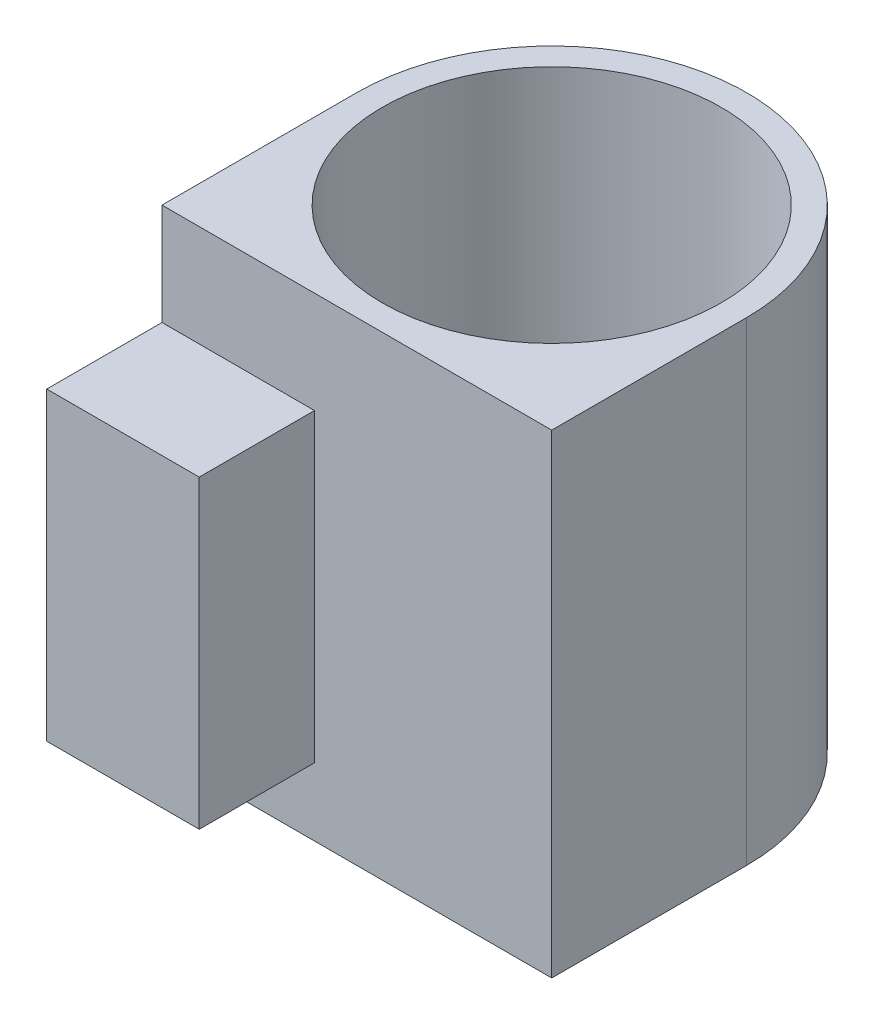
ISO-10303-21;
HEADER;
FILE_DESCRIPTION(('STEP AP214'),'2;1');
FILE_NAME('part.step','',(''),(''),'','','');
FILE_SCHEMA(('AUTOMOTIVE_DESIGN { 1 0 10303 214 1 1 1 1 }'));
ENDSEC;
DATA;
#1=APPLICATION_CONTEXT('core data for automotive mechanical design processes');
#2=APPLICATION_PROTOCOL_DEFINITION('international standard','automotive_design',2000,#1);
#3=PRODUCT_CONTEXT('',#1,'mechanical');
#4=PRODUCT('Part','Part','',(#3));
#5=PRODUCT_RELATED_PRODUCT_CATEGORY('part','',(#4));
#6=PRODUCT_DEFINITION_FORMATION('','',#4);
#7=PRODUCT_DEFINITION_CONTEXT('part definition',#1,'design');
#8=PRODUCT_DEFINITION('design','',#6,#7);
#9=PRODUCT_DEFINITION_SHAPE('','',#8);
#10=(LENGTH_UNIT() NAMED_UNIT(*) SI_UNIT(.MILLI.,.METRE.));
#11=(NAMED_UNIT(*) PLANE_ANGLE_UNIT() SI_UNIT($,.RADIAN.));
#12=(NAMED_UNIT(*) SI_UNIT($,.STERADIAN.) SOLID_ANGLE_UNIT());
#13=UNCERTAINTY_MEASURE_WITH_UNIT(LENGTH_MEASURE(1.E-05),#10,'distance_accuracy_value','');
#14=(GEOMETRIC_REPRESENTATION_CONTEXT(3) GLOBAL_UNCERTAINTY_ASSIGNED_CONTEXT((#13)) GLOBAL_UNIT_ASSIGNED_CONTEXT((#10,
#11,#12)) REPRESENTATION_CONTEXT('',''));
#15=CARTESIAN_POINT('',(0.,0.,0.));
#16=DIRECTION('',(0.,0.,1.));
#17=DIRECTION('',(1.,0.,0.));
#18=AXIS2_PLACEMENT_3D('',#15,#16,#17);
#19=CARTESIAN_POINT('',(0.,0.,0.));
#20=DIRECTION('',(0.,1.,0.));
#21=DIRECTION('',(0.,0.,1.));
#22=AXIS2_PLACEMENT_3D('',#19,#20,#21);
#23=PLANE('',#22);
#24=DIRECTION('',(-0.965925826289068,0.,0.258819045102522));
#25=VECTOR('',#24,1.);
#26=CARTESIAN_POINT('',(-0.667346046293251,0.,-2.49056935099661));
#27=LINE('',#26,#25);
#28=CARTESIAN_POINT('',(-3.39939685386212,0.,-1.75851854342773));
#29=VERTEX_POINT('',#28);
#30=CARTESIAN_POINT('',(-4.80526603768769,0.,-1.38181703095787));
#31=VERTEX_POINT('',#30);
#32=EDGE_CURVE('E12',#29,#31,#27,.T.);
#33=ORIENTED_EDGE('',*,*,#32,.T.);
#34=CARTESIAN_POINT('',(0.,0.,0.));
#35=DIRECTION('',(0.,1.,0.));
#36=DIRECTION('',(0.,0.,1.));
#37=AXIS2_PLACEMENT_3D('',#34,#35,#36);
#38=CIRCLE('',#37,5.);
#39=CARTESIAN_POINT('',(-3.59932167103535,0.,-3.4705739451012));
#40=VERTEX_POINT('',#39);
#41=EDGE_CURVE('E67',#40,#31,#38,.T.);
#42=ORIENTED_EDGE('',*,*,#41,.F.);
#43=DIRECTION('',(0.258819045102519,0.,0.965925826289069));
#44=VECTOR('',#43,1.);
#45=CARTESIAN_POINT('',(-2.49056935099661,0.,0.667346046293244));
#46=LINE('',#45,#44);
#47=CARTESIAN_POINT('',(-3.22262015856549,0.,-2.06470476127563));
#48=VERTEX_POINT('',#47);
#49=EDGE_CURVE('E127',#40,#48,#46,.T.);
#50=ORIENTED_EDGE('',*,*,#49,.T.);
#51=CARTESIAN_POINT('',(-3.46410161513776,0.,-2.));
#52=DIRECTION('',(0.,1.,0.));
#53=DIRECTION('',(0.,0.,1.));
#54=AXIS2_PLACEMENT_3D('',#51,#52,#53);
#55=CIRCLE('',#54,0.250000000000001);
#56=EDGE_CURVE('E113',#29,#48,#55,.T.);
#57=ORIENTED_EDGE('',*,*,#56,.F.);
#58=EDGE_LOOP('',(#33,#42,#50,#57));
#59=FACE_BOUND('',#58,.T.);
#60=ADVANCED_FACE('F58',(#59),#23,.F.);
#61=CARTESIAN_POINT('',(0.,6.71656166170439,0.));
#62=DIRECTION('',(0.,-1.,0.));
#63=DIRECTION('',(0.,0.,-1.));
#64=AXIS2_PLACEMENT_3D('',#61,#62,#63);
#65=CYLINDRICAL_SURFACE('',#64,5.);
#66=DIRECTION('',(0.,-1.,0.));
#67=VECTOR('',#66,1.);
#68=CARTESIAN_POINT('',(-4.80526603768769,6.71656166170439,-1.38181703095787));
#69=LINE('',#68,#67);
#70=CARTESIAN_POINT('',(-4.80526603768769,4.,-1.38181703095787));
#71=VERTEX_POINT('',#70);
#72=EDGE_CURVE('E75',#71,#31,#69,.T.);
#73=ORIENTED_EDGE('',*,*,#72,.F.);
#74=CARTESIAN_POINT('',(0.,4.,0.));
#75=DIRECTION('',(0.,-1.,0.));
#76=DIRECTION('',(0.,0.,-1.));
#77=AXIS2_PLACEMENT_3D('',#74,#75,#76);
#78=CIRCLE('',#77,5.);
#79=CARTESIAN_POINT('',(-3.59932167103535,4.,-3.4705739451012));
#80=VERTEX_POINT('',#79);
#81=EDGE_CURVE('E120',#71,#80,#78,.T.);
#82=ORIENTED_EDGE('',*,*,#81,.T.);
#83=DIRECTION('',(0.,-1.,0.));
#84=VECTOR('',#83,1.);
#85=CARTESIAN_POINT('',(-3.59932167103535,6.71656166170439,-3.4705739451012));
#86=LINE('',#85,#84);
#87=EDGE_CURVE('E82',#80,#40,#86,.T.);
#88=ORIENTED_EDGE('',*,*,#87,.T.);
#89=ORIENTED_EDGE('',*,*,#41,.T.);
#90=EDGE_LOOP('',(#73,#82,#88,#89));
#91=FACE_BOUND('',#90,.T.);
#92=ADVANCED_FACE('F130',(#91),#65,.T.);
#93=CARTESIAN_POINT('',(-2.49056935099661,6.71656166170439,0.667346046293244));
#94=DIRECTION('',(0.965925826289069,0.,-0.258819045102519));
#95=DIRECTION('',(-0.258819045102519,0.,-0.965925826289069));
#96=AXIS2_PLACEMENT_3D('',#93,#94,#95);
#97=PLANE('',#96);
#98=DIRECTION('',(-0.258819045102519,0.,-0.965925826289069));
#99=VECTOR('',#98,1.);
#100=CARTESIAN_POINT('',(-2.49056935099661,4.,0.667346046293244));
#101=LINE('',#100,#99);
#102=CARTESIAN_POINT('',(-3.22262015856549,4.,-2.06470476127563));
#103=VERTEX_POINT('',#102);
#104=EDGE_CURVE('E62',#103,#80,#101,.T.);
#105=ORIENTED_EDGE('',*,*,#104,.F.);
#106=DIRECTION('',(0.,-1.,0.));
#107=VECTOR('',#106,1.);
#108=CARTESIAN_POINT('',(-3.22262015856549,6.71656166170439,-2.06470476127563));
#109=LINE('',#108,#107);
#110=EDGE_CURVE('E110',#103,#48,#109,.T.);
#111=ORIENTED_EDGE('',*,*,#110,.T.);
#112=ORIENTED_EDGE('',*,*,#49,.F.);
#113=ORIENTED_EDGE('',*,*,#87,.F.);
#114=EDGE_LOOP('',(#105,#111,#112,#113));
#115=FACE_BOUND('',#114,.T.);
#116=ADVANCED_FACE('F119',(#115),#97,.T.);
#117=CARTESIAN_POINT('',(-3.46410161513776,6.71656166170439,-2.));
#118=DIRECTION('',(0.,-1.,0.));
#119=DIRECTION('',(0.,0.,-1.));
#120=AXIS2_PLACEMENT_3D('',#117,#118,#119);
#121=CYLINDRICAL_SURFACE('',#120,0.250000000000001);
#122=ORIENTED_EDGE('',*,*,#110,.F.);
#123=CARTESIAN_POINT('',(-3.46410161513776,4.,-2.));
#124=DIRECTION('',(0.,-1.,0.));
#125=DIRECTION('',(0.,0.,-1.));
#126=AXIS2_PLACEMENT_3D('',#123,#124,#125);
#127=CIRCLE('',#126,0.250000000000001);
#128=CARTESIAN_POINT('',(-3.39939685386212,4.,-1.75851854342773));
#129=VERTEX_POINT('',#128);
#130=EDGE_CURVE('E103',#103,#129,#127,.T.);
#131=ORIENTED_EDGE('',*,*,#130,.T.);
#132=DIRECTION('',(0.,-1.,0.));
#133=VECTOR('',#132,1.);
#134=CARTESIAN_POINT('',(-3.39939685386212,6.71656166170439,-1.75851854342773));
#135=LINE('',#134,#133);
#136=EDGE_CURVE('E117',#129,#29,#135,.T.);
#137=ORIENTED_EDGE('',*,*,#136,.T.);
#138=ORIENTED_EDGE('',*,*,#56,.T.);
#139=EDGE_LOOP('',(#122,#131,#137,#138));
#140=FACE_BOUND('',#139,.T.);
#141=ADVANCED_FACE('F111',(#140),#121,.T.);
#142=CARTESIAN_POINT('',(-0.667346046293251,6.71656166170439,-2.49056935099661));
#143=DIRECTION('',(0.258819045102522,0.,0.965925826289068));
#144=DIRECTION('',(0.965925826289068,0.,-0.258819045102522));
#145=AXIS2_PLACEMENT_3D('',#142,#143,#144);
#146=PLANE('',#145);
#147=DIRECTION('',(0.965925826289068,0.,-0.258819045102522));
#148=VECTOR('',#147,1.);
#149=CARTESIAN_POINT('',(-0.667346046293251,4.,-2.49056935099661));
#150=LINE('',#149,#148);
#151=EDGE_CURVE('E106',#71,#129,#150,.T.);
#152=ORIENTED_EDGE('',*,*,#151,.F.);
#153=ORIENTED_EDGE('',*,*,#72,.T.);
#154=ORIENTED_EDGE('',*,*,#32,.F.);
#155=ORIENTED_EDGE('',*,*,#136,.F.);
#156=EDGE_LOOP('',(#152,#153,#154,#155));
#157=FACE_BOUND('',#156,.T.);
#158=ADVANCED_FACE('F132',(#157),#146,.T.);
#159=CARTESIAN_POINT('',(0.,4.,0.));
#160=DIRECTION('',(0.,-1.,0.));
#161=DIRECTION('',(0.,0.,-1.));
#162=AXIS2_PLACEMENT_3D('',#159,#160,#161);
#163=PLANE('',#162);
#164=ORIENTED_EDGE('',*,*,#151,.T.);
#165=ORIENTED_EDGE('',*,*,#130,.F.);
#166=ORIENTED_EDGE('',*,*,#104,.T.);
#167=ORIENTED_EDGE('',*,*,#81,.F.);
#168=EDGE_LOOP('',(#164,#165,#166,#167));
#169=FACE_BOUND('',#168,.T.);
#170=ADVANCED_FACE('F60',(#169),#163,.F.);
#171=CLOSED_SHELL('',(#60,#92,#116,#141,#158,#170));
#172=MANIFOLD_SOLID_BREP('B2',#171);
#173=CARTESIAN_POINT('',(0.,0.,0.));
#174=DIRECTION('',(0.,1.,0.));
#175=DIRECTION('',(0.,0.,1.));
#176=AXIS2_PLACEMENT_3D('',#173,#174,#175);
#177=PLANE('',#176);
#178=DIRECTION('',(0.258819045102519,0.,-0.965925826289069));
#179=VECTOR('',#178,1.);
#180=CARTESIAN_POINT('',(2.49056935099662,0.,0.667346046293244));
#181=LINE('',#180,#179);
#182=CARTESIAN_POINT('',(3.22262015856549,0.,-2.06470476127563));
#183=VERTEX_POINT('',#182);
#184=CARTESIAN_POINT('',(3.59932167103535,0.,-3.4705739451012));
#185=VERTEX_POINT('',#184);
#186=EDGE_CURVE('E56',#183,#185,#181,.T.);
#187=ORIENTED_EDGE('',*,*,#186,.T.);
#188=CARTESIAN_POINT('',(0.,0.,0.));
#189=DIRECTION('',(0.,1.,0.));
#190=DIRECTION('',(0.,0.,1.));
#191=AXIS2_PLACEMENT_3D('',#188,#189,#190);
#192=CIRCLE('',#191,5.);
#193=CARTESIAN_POINT('',(4.80526603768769,0.,-1.38181703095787));
#194=VERTEX_POINT('',#193);
#195=EDGE_CURVE('E201',#194,#185,#192,.T.);
#196=ORIENTED_EDGE('',*,*,#195,.F.);
#197=DIRECTION('',(-0.965925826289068,0.,-0.258819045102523));
#198=VECTOR('',#197,1.);
#199=CARTESIAN_POINT('',(0.667346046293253,0.,-2.49056935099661));
#200=LINE('',#199,#198);
#201=CARTESIAN_POINT('',(3.39939685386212,0.,-1.75851854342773));
#202=VERTEX_POINT('',#201);
#203=EDGE_CURVE('E261',#194,#202,#200,.T.);
#204=ORIENTED_EDGE('',*,*,#203,.T.);
#205=CARTESIAN_POINT('',(3.46410161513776,0.,-2.));
#206=DIRECTION('',(0.,1.,0.));
#207=DIRECTION('',(0.,0.,1.));
#208=AXIS2_PLACEMENT_3D('',#205,#206,#207);
#209=CIRCLE('',#208,0.25);
#210=EDGE_CURVE('E247',#183,#202,#209,.T.);
#211=ORIENTED_EDGE('',*,*,#210,.F.);
#212=EDGE_LOOP('',(#187,#196,#204,#211));
#213=FACE_BOUND('',#212,.T.);
#214=ADVANCED_FACE('F192',(#213),#177,.F.);
#215=CARTESIAN_POINT('',(0.,6.71656166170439,0.));
#216=DIRECTION('',(0.,-1.,0.));
#217=DIRECTION('',(0.,0.,-1.));
#218=AXIS2_PLACEMENT_3D('',#215,#216,#217);
#219=CYLINDRICAL_SURFACE('',#218,5.);
#220=DIRECTION('',(0.,-1.,0.));
#221=VECTOR('',#220,1.);
#222=CARTESIAN_POINT('',(3.59932167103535,6.71656166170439,-3.4705739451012));
#223=LINE('',#222,#221);
#224=CARTESIAN_POINT('',(3.59932167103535,4.,-3.4705739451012));
#225=VERTEX_POINT('',#224);
#226=EDGE_CURVE('E209',#225,#185,#223,.T.);
#227=ORIENTED_EDGE('',*,*,#226,.F.);
#228=CARTESIAN_POINT('',(0.,4.,0.));
#229=DIRECTION('',(0.,-1.,0.));
#230=DIRECTION('',(0.,0.,-1.));
#231=AXIS2_PLACEMENT_3D('',#228,#229,#230);
#232=CIRCLE('',#231,5.);
#233=CARTESIAN_POINT('',(4.80526603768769,4.,-1.38181703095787));
#234=VERTEX_POINT('',#233);
#235=EDGE_CURVE('E254',#225,#234,#232,.T.);
#236=ORIENTED_EDGE('',*,*,#235,.T.);
#237=DIRECTION('',(0.,-1.,0.));
#238=VECTOR('',#237,1.);
#239=CARTESIAN_POINT('',(4.80526603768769,6.71656166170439,-1.38181703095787));
#240=LINE('',#239,#238);
#241=EDGE_CURVE('E216',#234,#194,#240,.T.);
#242=ORIENTED_EDGE('',*,*,#241,.T.);
#243=ORIENTED_EDGE('',*,*,#195,.T.);
#244=EDGE_LOOP('',(#227,#236,#242,#243));
#245=FACE_BOUND('',#244,.T.);
#246=ADVANCED_FACE('F264',(#245),#219,.T.);
#247=CARTESIAN_POINT('',(0.667346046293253,6.71656166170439,-2.49056935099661));
#248=DIRECTION('',(-0.258819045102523,0.,0.965925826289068));
#249=DIRECTION('',(0.965925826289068,0.,0.258819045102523));
#250=AXIS2_PLACEMENT_3D('',#247,#248,#249);
#251=PLANE('',#250);
#252=DIRECTION('',(0.965925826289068,0.,0.258819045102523));
#253=VECTOR('',#252,1.);
#254=CARTESIAN_POINT('',(0.667346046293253,4.,-2.49056935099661));
#255=LINE('',#254,#253);
#256=CARTESIAN_POINT('',(3.39939685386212,4.,-1.75851854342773));
#257=VERTEX_POINT('',#256);
#258=EDGE_CURVE('E196',#257,#234,#255,.T.);
#259=ORIENTED_EDGE('',*,*,#258,.F.);
#260=DIRECTION('',(0.,-1.,0.));
#261=VECTOR('',#260,1.);
#262=CARTESIAN_POINT('',(3.39939685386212,6.71656166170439,-1.75851854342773));
#263=LINE('',#262,#261);
#264=EDGE_CURVE('E244',#257,#202,#263,.T.);
#265=ORIENTED_EDGE('',*,*,#264,.T.);
#266=ORIENTED_EDGE('',*,*,#203,.F.);
#267=ORIENTED_EDGE('',*,*,#241,.F.);
#268=EDGE_LOOP('',(#259,#265,#266,#267));
#269=FACE_BOUND('',#268,.T.);
#270=ADVANCED_FACE('F253',(#269),#251,.T.);
#271=CARTESIAN_POINT('',(3.46410161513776,6.71656166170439,-2.));
#272=DIRECTION('',(0.,-1.,0.));
#273=DIRECTION('',(0.,0.,-1.));
#274=AXIS2_PLACEMENT_3D('',#271,#272,#273);
#275=CYLINDRICAL_SURFACE('',#274,0.25);
#276=ORIENTED_EDGE('',*,*,#264,.F.);
#277=CARTESIAN_POINT('',(3.46410161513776,4.,-2.));
#278=DIRECTION('',(0.,-1.,0.));
#279=DIRECTION('',(0.,0.,-1.));
#280=AXIS2_PLACEMENT_3D('',#277,#278,#279);
#281=CIRCLE('',#280,0.25);
#282=CARTESIAN_POINT('',(3.22262015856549,4.,-2.06470476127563));
#283=VERTEX_POINT('',#282);
#284=EDGE_CURVE('E237',#257,#283,#281,.T.);
#285=ORIENTED_EDGE('',*,*,#284,.T.);
#286=DIRECTION('',(0.,-1.,0.));
#287=VECTOR('',#286,1.);
#288=CARTESIAN_POINT('',(3.22262015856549,6.71656166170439,-2.06470476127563));
#289=LINE('',#288,#287);
#290=EDGE_CURVE('E251',#283,#183,#289,.T.);
#291=ORIENTED_EDGE('',*,*,#290,.T.);
#292=ORIENTED_EDGE('',*,*,#210,.T.);
#293=EDGE_LOOP('',(#276,#285,#291,#292));
#294=FACE_BOUND('',#293,.T.);
#295=ADVANCED_FACE('F245',(#294),#275,.T.);
#296=CARTESIAN_POINT('',(2.49056935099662,6.71656166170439,0.667346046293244));
#297=DIRECTION('',(-0.965925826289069,0.,-0.258819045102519));
#298=DIRECTION('',(-0.258819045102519,0.,0.965925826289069));
#299=AXIS2_PLACEMENT_3D('',#296,#297,#298);
#300=PLANE('',#299);
#301=DIRECTION('',(-0.258819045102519,0.,0.965925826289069));
#302=VECTOR('',#301,1.);
#303=CARTESIAN_POINT('',(2.49056935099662,4.,0.667346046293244));
#304=LINE('',#303,#302);
#305=EDGE_CURVE('E240',#225,#283,#304,.T.);
#306=ORIENTED_EDGE('',*,*,#305,.F.);
#307=ORIENTED_EDGE('',*,*,#226,.T.);
#308=ORIENTED_EDGE('',*,*,#186,.F.);
#309=ORIENTED_EDGE('',*,*,#290,.F.);
#310=EDGE_LOOP('',(#306,#307,#308,#309));
#311=FACE_BOUND('',#310,.T.);
#312=ADVANCED_FACE('F266',(#311),#300,.T.);
#313=CARTESIAN_POINT('',(0.,4.,0.));
#314=DIRECTION('',(0.,-1.,0.));
#315=DIRECTION('',(0.,0.,-1.));
#316=AXIS2_PLACEMENT_3D('',#313,#314,#315);
#317=PLANE('',#316);
#318=ORIENTED_EDGE('',*,*,#305,.T.);
#319=ORIENTED_EDGE('',*,*,#284,.F.);
#320=ORIENTED_EDGE('',*,*,#258,.T.);
#321=ORIENTED_EDGE('',*,*,#235,.F.);
#322=EDGE_LOOP('',(#318,#319,#320,#321));
#323=FACE_BOUND('',#322,.T.);
#324=ADVANCED_FACE('F194',(#323),#317,.F.);
#325=CLOSED_SHELL('',(#214,#246,#270,#295,#312,#324));
#326=MANIFOLD_SOLID_BREP('B6',#325);
#327=CARTESIAN_POINT('',(0.,0.,0.));
#328=DIRECTION('',(0.,1.,0.));
#329=DIRECTION('',(0.,0.,1.));
#330=AXIS2_PLACEMENT_3D('',#327,#328,#329);
#331=PLANE('',#330);
#332=DIRECTION('',(0.707106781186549,0.,0.707106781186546));
#333=VECTOR('',#332,1.);
#334=CARTESIAN_POINT('',(-1.82322330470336,0.,1.82322330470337));
#335=LINE('',#334,#333);
#336=CARTESIAN_POINT('',(0.176776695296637,0.,3.82322330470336));
#337=VERTEX_POINT('',#336);
#338=CARTESIAN_POINT('',(1.20594436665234,0.,4.85239097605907));
#339=VERTEX_POINT('',#338);
#340=EDGE_CURVE('E368',#337,#339,#335,.T.);
#341=ORIENTED_EDGE('',*,*,#340,.T.);
#342=CARTESIAN_POINT('',(0.,0.,0.));
#343=DIRECTION('',(0.,1.,0.));
#344=DIRECTION('',(0.,0.,1.));
#345=AXIS2_PLACEMENT_3D('',#342,#343,#344);
#346=CIRCLE('',#345,5.);
#347=CARTESIAN_POINT('',(-1.20594436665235,0.,4.85239097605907));
#348=VERTEX_POINT('',#347);
#349=EDGE_CURVE('E374',#348,#339,#346,.T.);
#350=ORIENTED_EDGE('',*,*,#349,.F.);
#351=DIRECTION('',(0.707106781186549,0.,-0.707106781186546));
#352=VECTOR('',#351,1.);
#353=CARTESIAN_POINT('',(1.82322330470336,0.,1.82322330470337));
#354=LINE('',#353,#352);
#355=CARTESIAN_POINT('',(-0.176776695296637,0.,3.82322330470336));
#356=VERTEX_POINT('',#355);
#357=EDGE_CURVE('E380',#348,#356,#354,.T.);
#358=ORIENTED_EDGE('',*,*,#357,.T.);
#359=CARTESIAN_POINT('',(0.,0.,4.));
#360=DIRECTION('',(0.,1.,0.));
#361=DIRECTION('',(0.,0.,1.));
#362=AXIS2_PLACEMENT_3D('',#359,#360,#361);
#363=CIRCLE('',#362,0.250000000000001);
#364=EDGE_CURVE('E372',#337,#356,#363,.T.);
#365=ORIENTED_EDGE('',*,*,#364,.F.);
#366=EDGE_LOOP('',(#341,#350,#358,#365));
#367=FACE_BOUND('',#366,.T.);
#368=ADVANCED_FACE('F326',(#367),#331,.F.);
#369=CARTESIAN_POINT('',(0.,6.71656166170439,0.));
#370=DIRECTION('',(0.,-1.,0.));
#371=DIRECTION('',(0.,0.,-1.));
#372=AXIS2_PLACEMENT_3D('',#369,#370,#371);
#373=CYLINDRICAL_SURFACE('',#372,5.);
#374=DIRECTION('',(0.,-1.,0.));
#375=VECTOR('',#374,1.);
#376=CARTESIAN_POINT('',(1.20594436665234,6.71656166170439,4.85239097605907));
#377=LINE('',#376,#375);
#378=CARTESIAN_POINT('',(1.20594436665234,4.,4.85239097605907));
#379=VERTEX_POINT('',#378);
#380=EDGE_CURVE('E365',#379,#339,#377,.T.);
#381=ORIENTED_EDGE('',*,*,#380,.F.);
#382=CARTESIAN_POINT('',(0.,4.,0.));
#383=DIRECTION('',(0.,-1.,0.));
#384=DIRECTION('',(0.,0.,-1.));
#385=AXIS2_PLACEMENT_3D('',#382,#383,#384);
#386=CIRCLE('',#385,5.);
#387=CARTESIAN_POINT('',(-1.20594436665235,4.,4.85239097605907));
#388=VERTEX_POINT('',#387);
#389=EDGE_CURVE('E330',#379,#388,#386,.T.);
#390=ORIENTED_EDGE('',*,*,#389,.T.);
#391=DIRECTION('',(0.,-1.,0.));
#392=VECTOR('',#391,1.);
#393=CARTESIAN_POINT('',(-1.20594436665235,6.71656166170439,4.85239097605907));
#394=LINE('',#393,#392);
#395=EDGE_CURVE('E371',#388,#348,#394,.T.);
#396=ORIENTED_EDGE('',*,*,#395,.T.);
#397=ORIENTED_EDGE('',*,*,#349,.T.);
#398=EDGE_LOOP('',(#381,#390,#396,#397));
#399=FACE_BOUND('',#398,.T.);
#400=ADVANCED_FACE('F375',(#399),#373,.T.);
#401=CARTESIAN_POINT('',(1.82322330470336,6.71656166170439,1.82322330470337));
#402=DIRECTION('',(-0.707106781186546,0.,-0.707106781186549));
#403=DIRECTION('',(-0.707106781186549,0.,0.707106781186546));
#404=AXIS2_PLACEMENT_3D('',#401,#402,#403);
#405=PLANE('',#404);
#406=DIRECTION('',(-0.707106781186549,0.,0.707106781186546));
#407=VECTOR('',#406,1.);
#408=CARTESIAN_POINT('',(1.82322330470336,4.,1.82322330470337));
#409=LINE('',#408,#407);
#410=CARTESIAN_POINT('',(-0.176776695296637,4.,3.82322330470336));
#411=VERTEX_POINT('',#410);
#412=EDGE_CURVE('E396',#411,#388,#409,.T.);
#413=ORIENTED_EDGE('',*,*,#412,.F.);
#414=DIRECTION('',(0.,-1.,0.));
#415=VECTOR('',#414,1.);
#416=CARTESIAN_POINT('',(-0.176776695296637,6.71656166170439,3.82322330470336));
#417=LINE('',#416,#415);
#418=EDGE_CURVE('E391',#411,#356,#417,.T.);
#419=ORIENTED_EDGE('',*,*,#418,.T.);
#420=ORIENTED_EDGE('',*,*,#357,.F.);
#421=ORIENTED_EDGE('',*,*,#395,.F.);
#422=EDGE_LOOP('',(#413,#419,#420,#421));
#423=FACE_BOUND('',#422,.T.);
#424=ADVANCED_FACE('F395',(#423),#405,.T.);
#425=CARTESIAN_POINT('',(0.,6.71656166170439,4.));
#426=DIRECTION('',(0.,-1.,0.));
#427=DIRECTION('',(0.,0.,-1.));
#428=AXIS2_PLACEMENT_3D('',#425,#426,#427);
#429=CYLINDRICAL_SURFACE('',#428,0.250000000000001);
#430=ORIENTED_EDGE('',*,*,#418,.F.);
#431=CARTESIAN_POINT('',(0.,4.,4.));
#432=DIRECTION('',(0.,-1.,0.));
#433=DIRECTION('',(0.,0.,-1.));
#434=AXIS2_PLACEMENT_3D('',#431,#432,#433);
#435=CIRCLE('',#434,0.250000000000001);
#436=CARTESIAN_POINT('',(0.176776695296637,4.,3.82322330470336));
#437=VERTEX_POINT('',#436);
#438=EDGE_CURVE('E335',#411,#437,#435,.T.);
#439=ORIENTED_EDGE('',*,*,#438,.T.);
#440=DIRECTION('',(0.,-1.,0.));
#441=VECTOR('',#440,1.);
#442=CARTESIAN_POINT('',(0.176776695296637,6.71656166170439,3.82322330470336));
#443=LINE('',#442,#441);
#444=EDGE_CURVE('E389',#437,#337,#443,.T.);
#445=ORIENTED_EDGE('',*,*,#444,.T.);
#446=ORIENTED_EDGE('',*,*,#364,.T.);
#447=EDGE_LOOP('',(#430,#439,#445,#446));
#448=FACE_BOUND('',#447,.T.);
#449=ADVANCED_FACE('F398',(#448),#429,.T.);
#450=CARTESIAN_POINT('',(-1.82322330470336,6.71656166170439,1.82322330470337));
#451=DIRECTION('',(0.707106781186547,0.,-0.707106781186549));
#452=DIRECTION('',(-0.707106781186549,0.,-0.707106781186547));
#453=AXIS2_PLACEMENT_3D('',#450,#451,#452);
#454=PLANE('',#453);
#455=DIRECTION('',(-0.707106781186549,0.,-0.707106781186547));
#456=VECTOR('',#455,1.);
#457=CARTESIAN_POINT('',(-1.82322330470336,4.,1.82322330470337));
#458=LINE('',#457,#456);
#459=EDGE_CURVE('E190',#379,#437,#458,.T.);
#460=ORIENTED_EDGE('',*,*,#459,.F.);
#461=ORIENTED_EDGE('',*,*,#380,.T.);
#462=ORIENTED_EDGE('',*,*,#340,.F.);
#463=ORIENTED_EDGE('',*,*,#444,.F.);
#464=EDGE_LOOP('',(#460,#461,#462,#463));
#465=FACE_BOUND('',#464,.T.);
#466=ADVANCED_FACE('F328',(#465),#454,.T.);
#467=CARTESIAN_POINT('',(0.,4.,0.));
#468=DIRECTION('',(0.,-1.,0.));
#469=DIRECTION('',(0.,0.,-1.));
#470=AXIS2_PLACEMENT_3D('',#467,#468,#469);
#471=PLANE('',#470);
#472=ORIENTED_EDGE('',*,*,#459,.T.);
#473=ORIENTED_EDGE('',*,*,#438,.F.);
#474=ORIENTED_EDGE('',*,*,#412,.T.);
#475=ORIENTED_EDGE('',*,*,#389,.F.);
#476=EDGE_LOOP('',(#472,#473,#474,#475));
#477=FACE_BOUND('',#476,.T.);
#478=ADVANCED_FACE('F400',(#477),#471,.F.);
#479=CLOSED_SHELL('',(#368,#400,#424,#449,#466,#478));
#480=MANIFOLD_SOLID_BREP('B50',#479);
#481=CARTESIAN_POINT('',(2.38156986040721,2.5,1.375));
#482=DIRECTION('',(0.,1.,0.));
#483=DIRECTION('',(0.,0.,1.));
#484=AXIS2_PLACEMENT_3D('',#481,#482,#483);
#485=CYLINDRICAL_SURFACE('',#484,0.249999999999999);
#486=CARTESIAN_POINT('',(2.38156986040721,5.,1.375));
#487=DIRECTION('',(0.,-1.,0.));
#488=DIRECTION('',(0.,0.,1.));
#489=AXIS2_PLACEMENT_3D('',#486,#487,#488);
#490=CIRCLE('',#489,0.249999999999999);
#491=CARTESIAN_POINT('',(2.1832315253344,5.,1.52719035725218));
#492=VERTEX_POINT('',#491);
#493=CARTESIAN_POINT('',(2.41420140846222,5.,1.12713878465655));
#494=VERTEX_POINT('',#493);
#495=EDGE_CURVE('E324',#492,#494,#490,.T.);
#496=ORIENTED_EDGE('',*,*,#495,.T.);
#497=DIRECTION('',(0.,1.,0.));
#498=VECTOR('',#497,1.);
#499=CARTESIAN_POINT('',(2.41420140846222,2.5,1.12713878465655));
#500=LINE('',#499,#498);
#501=CARTESIAN_POINT('',(2.41420140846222,2.5,1.12713878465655));
#502=VERTEX_POINT('',#501);
#503=EDGE_CURVE('E531',#502,#494,#500,.T.);
#504=ORIENTED_EDGE('',*,*,#503,.F.);
#505=CARTESIAN_POINT('',(2.38156986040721,2.5,1.375));
#506=DIRECTION('',(0.,-1.,0.));
#507=DIRECTION('',(0.,0.,1.));
#508=AXIS2_PLACEMENT_3D('',#505,#506,#507);
#509=CIRCLE('',#508,0.249999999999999);
#510=CARTESIAN_POINT('',(2.1832315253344,2.5,1.52719035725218));
#511=VERTEX_POINT('',#510);
#512=EDGE_CURVE('E464',#511,#502,#509,.T.);
#513=ORIENTED_EDGE('',*,*,#512,.F.);
#514=DIRECTION('',(0.,1.,0.));
#515=VECTOR('',#514,1.);
#516=CARTESIAN_POINT('',(2.1832315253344,2.5,1.52719035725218));
#517=LINE('',#516,#515);
#518=EDGE_CURVE('E519',#511,#492,#517,.T.);
#519=ORIENTED_EDGE('',*,*,#518,.T.);
#520=EDGE_LOOP('',(#496,#504,#513,#519));
#521=FACE_BOUND('',#520,.T.);
#522=ADVANCED_FACE('F460',(#521),#485,.T.);
#523=CARTESIAN_POINT('',(4.78824596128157,2.5,1.43968767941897));
#524=DIRECTION('',(-0.130526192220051,0.,0.991444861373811));
#525=DIRECTION('',(0.991444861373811,0.,0.130526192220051));
#526=AXIS2_PLACEMENT_3D('',#523,#524,#525);
#527=PLANE('',#526);
#528=DIRECTION('',(0.991444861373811,0.,0.130526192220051));
#529=VECTOR('',#528,1.);
#530=CARTESIAN_POINT('',(4.78824596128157,5.,1.43968767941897));
#531=LINE('',#530,#529);
#532=CARTESIAN_POINT('',(4.78824596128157,5.,1.43968767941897));
#533=VERTEX_POINT('',#532);
#534=EDGE_CURVE('E470',#494,#533,#531,.T.);
#535=ORIENTED_EDGE('',*,*,#534,.T.);
#536=DIRECTION('',(0.,1.,0.));
#537=VECTOR('',#536,1.);
#538=CARTESIAN_POINT('',(4.78824596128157,2.5,1.43968767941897));
#539=LINE('',#538,#537);
#540=CARTESIAN_POINT('',(4.78824596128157,2.5,1.43968767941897));
#541=VERTEX_POINT('',#540);
#542=EDGE_CURVE('E515',#541,#533,#539,.T.);
#543=ORIENTED_EDGE('',*,*,#542,.F.);
#544=DIRECTION('',(0.991444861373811,0.,0.130526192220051));
#545=VECTOR('',#544,1.);
#546=CARTESIAN_POINT('',(4.78824596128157,2.5,1.43968767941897));
#547=LINE('',#546,#545);
#548=EDGE_CURVE('E494',#502,#541,#547,.T.);
#549=ORIENTED_EDGE('',*,*,#548,.F.);
#550=ORIENTED_EDGE('',*,*,#503,.T.);
#551=EDGE_LOOP('',(#535,#543,#549,#550));
#552=FACE_BOUND('',#551,.T.);
#553=ADVANCED_FACE('F534',(#552),#527,.F.);
#554=CARTESIAN_POINT('',(0.,2.5,0.));
#555=DIRECTION('',(0.,1.,0.));
#556=DIRECTION('',(0.,0.,1.));
#557=AXIS2_PLACEMENT_3D('',#554,#555,#556);
#558=CYLINDRICAL_SURFACE('',#557,5.);
#559=CARTESIAN_POINT('',(0.,5.,0.));
#560=DIRECTION('',(0.,-1.,0.));
#561=DIRECTION('',(0.,0.,1.));
#562=AXIS2_PLACEMENT_3D('',#559,#560,#561);
#563=CIRCLE('',#562,5.);
#564=CARTESIAN_POINT('',(3.64092908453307,5.,3.4268988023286));
#565=VERTEX_POINT('',#564);
#566=EDGE_CURVE('E510',#533,#565,#563,.T.);
#567=ORIENTED_EDGE('',*,*,#566,.T.);
#568=DIRECTION('',(0.,1.,0.));
#569=VECTOR('',#568,1.);
#570=CARTESIAN_POINT('',(3.64092908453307,2.5,3.4268988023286));
#571=LINE('',#570,#569);
#572=CARTESIAN_POINT('',(3.64092908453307,2.5,3.4268988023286));
#573=VERTEX_POINT('',#572);
#574=EDGE_CURVE('E513',#573,#565,#571,.T.);
#575=ORIENTED_EDGE('',*,*,#574,.F.);
#576=CARTESIAN_POINT('',(0.,2.5,0.));
#577=DIRECTION('',(0.,-1.,0.));
#578=DIRECTION('',(0.,0.,1.));
#579=AXIS2_PLACEMENT_3D('',#576,#577,#578);
#580=CIRCLE('',#579,5.);
#581=EDGE_CURVE('E527',#541,#573,#580,.T.);
#582=ORIENTED_EDGE('',*,*,#581,.F.);
#583=ORIENTED_EDGE('',*,*,#542,.T.);
#584=EDGE_LOOP('',(#567,#575,#582,#583));
#585=FACE_BOUND('',#584,.T.);
#586=ADVANCED_FACE('F511',(#585),#558,.T.);
#587=CARTESIAN_POINT('',(3.64092908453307,2.5,3.4268988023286));
#588=DIRECTION('',(0.793353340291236,0.,-0.608761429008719));
#589=DIRECTION('',(-0.608761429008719,0.,-0.793353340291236));
#590=AXIS2_PLACEMENT_3D('',#587,#588,#589);
#591=PLANE('',#590);
#592=DIRECTION('',(-0.608761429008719,0.,-0.793353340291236));
#593=VECTOR('',#592,1.);
#594=CARTESIAN_POINT('',(3.64092908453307,5.,3.4268988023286));
#595=LINE('',#594,#593);
#596=EDGE_CURVE('E504',#565,#492,#595,.T.);
#597=ORIENTED_EDGE('',*,*,#596,.T.);
#598=ORIENTED_EDGE('',*,*,#518,.F.);
#599=DIRECTION('',(-0.608761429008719,0.,-0.793353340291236));
#600=VECTOR('',#599,1.);
#601=CARTESIAN_POINT('',(3.64092908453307,2.5,3.4268988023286));
#602=LINE('',#601,#600);
#603=EDGE_CURVE('E518',#573,#511,#602,.T.);
#604=ORIENTED_EDGE('',*,*,#603,.F.);
#605=ORIENTED_EDGE('',*,*,#574,.T.);
#606=EDGE_LOOP('',(#597,#598,#604,#605));
#607=FACE_BOUND('',#606,.T.);
#608=ADVANCED_FACE('F517',(#607),#591,.F.);
#609=CARTESIAN_POINT('',(2.38156986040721,2.5,1.375));
#610=DIRECTION('',(0.,1.,0.));
#611=DIRECTION('',(0.,0.,1.));
#612=AXIS2_PLACEMENT_3D('',#609,#610,#611);
#613=PLANE('',#612);
#614=ORIENTED_EDGE('',*,*,#512,.T.);
#615=ORIENTED_EDGE('',*,*,#548,.T.);
#616=ORIENTED_EDGE('',*,*,#581,.T.);
#617=ORIENTED_EDGE('',*,*,#603,.T.);
#618=EDGE_LOOP('',(#614,#615,#616,#617));
#619=FACE_BOUND('',#618,.T.);
#620=ADVANCED_FACE('F462',(#619),#613,.F.);
#621=CARTESIAN_POINT('',(2.38156986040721,5.,1.375));
#622=DIRECTION('',(0.,1.,0.));
#623=DIRECTION('',(0.,0.,1.));
#624=AXIS2_PLACEMENT_3D('',#621,#622,#623);
#625=PLANE('',#624);
#626=ORIENTED_EDGE('',*,*,#495,.F.);
#627=ORIENTED_EDGE('',*,*,#596,.F.);
#628=ORIENTED_EDGE('',*,*,#566,.F.);
#629=ORIENTED_EDGE('',*,*,#534,.F.);
#630=EDGE_LOOP('',(#626,#627,#628,#629));
#631=FACE_BOUND('',#630,.T.);
#632=ADVANCED_FACE('F521',(#631),#625,.T.);
#633=CLOSED_SHELL('',(#522,#553,#586,#608,#620,#632));
#634=MANIFOLD_SOLID_BREP('B184',#633);
#635=CARTESIAN_POINT('',(-2.38156986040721,2.5,1.375));
#636=DIRECTION('',(0.,1.,0.));
#637=DIRECTION('',(0.,0.,1.));
#638=AXIS2_PLACEMENT_3D('',#635,#636,#637);
#639=CYLINDRICAL_SURFACE('',#638,0.249999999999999);
#640=CARTESIAN_POINT('',(-2.38156986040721,5.,1.375));
#641=DIRECTION('',(0.,-1.,0.));
#642=DIRECTION('',(0.,0.,1.));
#643=AXIS2_PLACEMENT_3D('',#640,#641,#642);
#644=CIRCLE('',#643,0.249999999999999);
#645=CARTESIAN_POINT('',(-2.41420140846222,5.,1.12713878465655));
#646=VERTEX_POINT('',#645);
#647=CARTESIAN_POINT('',(-2.1832315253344,5.,1.52719035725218));
#648=VERTEX_POINT('',#647);
#649=EDGE_CURVE('E458',#646,#648,#644,.T.);
#650=ORIENTED_EDGE('',*,*,#649,.T.);
#651=DIRECTION('',(0.,1.,0.));
#652=VECTOR('',#651,1.);
#653=CARTESIAN_POINT('',(-2.1832315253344,2.5,1.52719035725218));
#654=LINE('',#653,#652);
#655=CARTESIAN_POINT('',(-2.1832315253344,2.5,1.52719035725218));
#656=VERTEX_POINT('',#655);
#657=EDGE_CURVE('E665',#656,#648,#654,.T.);
#658=ORIENTED_EDGE('',*,*,#657,.F.);
#659=CARTESIAN_POINT('',(-2.38156986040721,2.5,1.375));
#660=DIRECTION('',(0.,-1.,0.));
#661=DIRECTION('',(0.,0.,1.));
#662=AXIS2_PLACEMENT_3D('',#659,#660,#661);
#663=CIRCLE('',#662,0.249999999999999);
#664=CARTESIAN_POINT('',(-2.41420140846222,2.5,1.12713878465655));
#665=VERTEX_POINT('',#664);
#666=EDGE_CURVE('E598',#665,#656,#663,.T.);
#667=ORIENTED_EDGE('',*,*,#666,.F.);
#668=DIRECTION('',(0.,1.,0.));
#669=VECTOR('',#668,1.);
#670=CARTESIAN_POINT('',(-2.41420140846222,2.5,1.12713878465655));
#671=LINE('',#670,#669);
#672=EDGE_CURVE('E653',#665,#646,#671,.T.);
#673=ORIENTED_EDGE('',*,*,#672,.T.);
#674=EDGE_LOOP('',(#650,#658,#667,#673));
#675=FACE_BOUND('',#674,.T.);
#676=ADVANCED_FACE('F594',(#675),#639,.T.);
#677=CARTESIAN_POINT('',(-3.64092908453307,2.5,3.42689880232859));
#678=DIRECTION('',(-0.793353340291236,0.,-0.60876142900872));
#679=DIRECTION('',(-0.60876142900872,0.,0.793353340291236));
#680=AXIS2_PLACEMENT_3D('',#677,#678,#679);
#681=PLANE('',#680);
#682=DIRECTION('',(-0.60876142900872,0.,0.793353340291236));
#683=VECTOR('',#682,1.);
#684=CARTESIAN_POINT('',(-3.64092908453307,5.,3.42689880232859));
#685=LINE('',#684,#683);
#686=CARTESIAN_POINT('',(-3.64092908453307,5.,3.42689880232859));
#687=VERTEX_POINT('',#686);
#688=EDGE_CURVE('E604',#648,#687,#685,.T.);
#689=ORIENTED_EDGE('',*,*,#688,.T.);
#690=DIRECTION('',(0.,1.,0.));
#691=VECTOR('',#690,1.);
#692=CARTESIAN_POINT('',(-3.64092908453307,2.5,3.42689880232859));
#693=LINE('',#692,#691);
#694=CARTESIAN_POINT('',(-3.64092908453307,2.5,3.42689880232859));
#695=VERTEX_POINT('',#694);
#696=EDGE_CURVE('E649',#695,#687,#693,.T.);
#697=ORIENTED_EDGE('',*,*,#696,.F.);
#698=DIRECTION('',(-0.60876142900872,0.,0.793353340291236));
#699=VECTOR('',#698,1.);
#700=CARTESIAN_POINT('',(-3.64092908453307,2.5,3.42689880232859));
#701=LINE('',#700,#699);
#702=EDGE_CURVE('E628',#656,#695,#701,.T.);
#703=ORIENTED_EDGE('',*,*,#702,.F.);
#704=ORIENTED_EDGE('',*,*,#657,.T.);
#705=EDGE_LOOP('',(#689,#697,#703,#704));
#706=FACE_BOUND('',#705,.T.);
#707=ADVANCED_FACE('F668',(#706),#681,.F.);
#708=CARTESIAN_POINT('',(0.,2.5,0.));
#709=DIRECTION('',(0.,1.,0.));
#710=DIRECTION('',(0.,0.,1.));
#711=AXIS2_PLACEMENT_3D('',#708,#709,#710);
#712=CYLINDRICAL_SURFACE('',#711,5.);
#713=CARTESIAN_POINT('',(0.,5.,0.));
#714=DIRECTION('',(0.,-1.,0.));
#715=DIRECTION('',(0.,0.,1.));
#716=AXIS2_PLACEMENT_3D('',#713,#714,#715);
#717=CIRCLE('',#716,5.);
#718=CARTESIAN_POINT('',(-4.78824596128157,5.,1.43968767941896));
#719=VERTEX_POINT('',#718);
#720=EDGE_CURVE('E644',#687,#719,#717,.T.);
#721=ORIENTED_EDGE('',*,*,#720,.T.);
#722=DIRECTION('',(0.,1.,0.));
#723=VECTOR('',#722,1.);
#724=CARTESIAN_POINT('',(-4.78824596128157,2.5,1.43968767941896));
#725=LINE('',#724,#723);
#726=CARTESIAN_POINT('',(-4.78824596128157,2.5,1.43968767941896));
#727=VERTEX_POINT('',#726);
#728=EDGE_CURVE('E647',#727,#719,#725,.T.);
#729=ORIENTED_EDGE('',*,*,#728,.F.);
#730=CARTESIAN_POINT('',(0.,2.5,0.));
#731=DIRECTION('',(0.,-1.,0.));
#732=DIRECTION('',(0.,0.,1.));
#733=AXIS2_PLACEMENT_3D('',#730,#731,#732);
#734=CIRCLE('',#733,5.);
#735=EDGE_CURVE('E661',#695,#727,#734,.T.);
#736=ORIENTED_EDGE('',*,*,#735,.F.);
#737=ORIENTED_EDGE('',*,*,#696,.T.);
#738=EDGE_LOOP('',(#721,#729,#736,#737));
#739=FACE_BOUND('',#738,.T.);
#740=ADVANCED_FACE('F645',(#739),#712,.T.);
#741=CARTESIAN_POINT('',(-4.78824596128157,2.5,1.43968767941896));
#742=DIRECTION('',(0.13052619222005,0.,0.991444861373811));
#743=DIRECTION('',(0.991444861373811,0.,-0.13052619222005));
#744=AXIS2_PLACEMENT_3D('',#741,#742,#743);
#745=PLANE('',#744);
#746=DIRECTION('',(0.991444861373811,0.,-0.13052619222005));
#747=VECTOR('',#746,1.);
#748=CARTESIAN_POINT('',(-4.78824596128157,5.,1.43968767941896));
#749=LINE('',#748,#747);
#750=EDGE_CURVE('E638',#719,#646,#749,.T.);
#751=ORIENTED_EDGE('',*,*,#750,.T.);
#752=ORIENTED_EDGE('',*,*,#672,.F.);
#753=DIRECTION('',(0.991444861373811,0.,-0.13052619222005));
#754=VECTOR('',#753,1.);
#755=CARTESIAN_POINT('',(-4.78824596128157,2.5,1.43968767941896));
#756=LINE('',#755,#754);
#757=EDGE_CURVE('E652',#727,#665,#756,.T.);
#758=ORIENTED_EDGE('',*,*,#757,.F.);
#759=ORIENTED_EDGE('',*,*,#728,.T.);
#760=EDGE_LOOP('',(#751,#752,#758,#759));
#761=FACE_BOUND('',#760,.T.);
#762=ADVANCED_FACE('F651',(#761),#745,.F.);
#763=CARTESIAN_POINT('',(-2.38156986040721,2.5,1.375));
#764=DIRECTION('',(0.,1.,0.));
#765=DIRECTION('',(0.,0.,1.));
#766=AXIS2_PLACEMENT_3D('',#763,#764,#765);
#767=PLANE('',#766);
#768=ORIENTED_EDGE('',*,*,#666,.T.);
#769=ORIENTED_EDGE('',*,*,#702,.T.);
#770=ORIENTED_EDGE('',*,*,#735,.T.);
#771=ORIENTED_EDGE('',*,*,#757,.T.);
#772=EDGE_LOOP('',(#768,#769,#770,#771));
#773=FACE_BOUND('',#772,.T.);
#774=ADVANCED_FACE('F596',(#773),#767,.F.);
#775=CARTESIAN_POINT('',(-2.38156986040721,5.,1.375));
#776=DIRECTION('',(0.,1.,0.));
#777=DIRECTION('',(0.,0.,1.));
#778=AXIS2_PLACEMENT_3D('',#775,#776,#777);
#779=PLANE('',#778);
#780=ORIENTED_EDGE('',*,*,#649,.F.);
#781=ORIENTED_EDGE('',*,*,#750,.F.);
#782=ORIENTED_EDGE('',*,*,#720,.F.);
#783=ORIENTED_EDGE('',*,*,#688,.F.);
#784=EDGE_LOOP('',(#780,#781,#782,#783));
#785=FACE_BOUND('',#784,.T.);
#786=ADVANCED_FACE('F655',(#785),#779,.T.);
#787=CLOSED_SHELL('',(#676,#707,#740,#762,#774,#786));
#788=MANIFOLD_SOLID_BREP('B318',#787);
#789=CARTESIAN_POINT('',(0.,2.5,-2.75));
#790=DIRECTION('',(0.,1.,0.));
#791=DIRECTION('',(0.,0.,1.));
#792=AXIS2_PLACEMENT_3D('',#789,#790,#791);
#793=CYLINDRICAL_SURFACE('',#792,0.249999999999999);
#794=CARTESIAN_POINT('',(0.,5.,-2.75));
#795=DIRECTION('',(0.,-1.,0.));
#796=DIRECTION('',(0.,0.,1.));
#797=AXIS2_PLACEMENT_3D('',#794,#795,#796);
#798=CIRCLE('',#797,0.249999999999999);
#799=CARTESIAN_POINT('',(0.230969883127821,5.,-2.65432914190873));
#800=VERTEX_POINT('',#799);
#801=CARTESIAN_POINT('',(-0.230969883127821,5.,-2.65432914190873));
#802=VERTEX_POINT('',#801);
#803=EDGE_CURVE('E790',#800,#802,#798,.T.);
#804=ORIENTED_EDGE('',*,*,#803,.T.);
#805=DIRECTION('',(0.,1.,0.));
#806=VECTOR('',#805,1.);
#807=CARTESIAN_POINT('',(-0.230969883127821,2.5,-2.65432914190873));
#808=LINE('',#807,#806);
#809=CARTESIAN_POINT('',(-0.230969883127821,2.5,-2.65432914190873));
#810=VERTEX_POINT('',#809);
#811=EDGE_CURVE('E592',#810,#802,#808,.T.);
#812=ORIENTED_EDGE('',*,*,#811,.F.);
#813=CARTESIAN_POINT('',(0.,2.5,-2.75));
#814=DIRECTION('',(0.,-1.,0.));
#815=DIRECTION('',(0.,0.,1.));
#816=AXIS2_PLACEMENT_3D('',#813,#814,#815);
#817=CIRCLE('',#816,0.249999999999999);
#818=CARTESIAN_POINT('',(0.230969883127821,2.5,-2.65432914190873));
#819=VERTEX_POINT('',#818);
#820=EDGE_CURVE('E778',#819,#810,#817,.T.);
#821=ORIENTED_EDGE('',*,*,#820,.F.);
#822=DIRECTION('',(0.,1.,0.));
#823=VECTOR('',#822,1.);
#824=CARTESIAN_POINT('',(0.230969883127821,2.5,-2.65432914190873));
#825=LINE('',#824,#823);
#826=EDGE_CURVE('E786',#819,#800,#825,.T.);
#827=ORIENTED_EDGE('',*,*,#826,.T.);
#828=EDGE_LOOP('',(#804,#812,#821,#827));
#829=FACE_BOUND('',#828,.T.);
#830=ADVANCED_FACE('F727',(#829),#793,.T.);
#831=CARTESIAN_POINT('',(-1.14731687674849,2.5,-4.86658648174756));
#832=DIRECTION('',(0.923879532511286,0.,-0.382683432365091));
#833=DIRECTION('',(-0.382683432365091,0.,-0.923879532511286));
#834=AXIS2_PLACEMENT_3D('',#831,#832,#833);
#835=PLANE('',#834);
#836=DIRECTION('',(-0.382683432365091,0.,-0.923879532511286));
#837=VECTOR('',#836,1.);
#838=CARTESIAN_POINT('',(-1.14731687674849,5.,-4.86658648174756));
#839=LINE('',#838,#837);
#840=CARTESIAN_POINT('',(-1.14731687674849,5.,-4.86658648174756));
#841=VERTEX_POINT('',#840);
#842=EDGE_CURVE('E782',#802,#841,#839,.T.);
#843=ORIENTED_EDGE('',*,*,#842,.T.);
#844=DIRECTION('',(0.,1.,0.));
#845=VECTOR('',#844,1.);
#846=CARTESIAN_POINT('',(-1.14731687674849,2.5,-4.86658648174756));
#847=LINE('',#846,#845);
#848=CARTESIAN_POINT('',(-1.14731687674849,2.5,-4.86658648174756));
#849=VERTEX_POINT('',#848);
#850=EDGE_CURVE('E735',#849,#841,#847,.T.);
#851=ORIENTED_EDGE('',*,*,#850,.F.);
#852=DIRECTION('',(-0.382683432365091,0.,-0.923879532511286));
#853=VECTOR('',#852,1.);
#854=CARTESIAN_POINT('',(-1.14731687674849,2.5,-4.86658648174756));
#855=LINE('',#854,#853);
#856=EDGE_CURVE('E773',#810,#849,#855,.T.);
#857=ORIENTED_EDGE('',*,*,#856,.F.);
#858=ORIENTED_EDGE('',*,*,#811,.T.);
#859=EDGE_LOOP('',(#843,#851,#857,#858));
#860=FACE_BOUND('',#859,.T.);
#861=ADVANCED_FACE('F781',(#860),#835,.F.);
#862=CARTESIAN_POINT('',(0.,2.5,0.));
#863=DIRECTION('',(0.,1.,0.));
#864=DIRECTION('',(0.,0.,1.));
#865=AXIS2_PLACEMENT_3D('',#862,#863,#864);
#866=CYLINDRICAL_SURFACE('',#865,5.);
#867=CARTESIAN_POINT('',(0.,5.,0.));
#868=DIRECTION('',(0.,-1.,0.));
#869=DIRECTION('',(0.,0.,1.));
#870=AXIS2_PLACEMENT_3D('',#867,#868,#869);
#871=CIRCLE('',#870,5.);
#872=CARTESIAN_POINT('',(1.14731687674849,5.,-4.86658648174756));
#873=VERTEX_POINT('',#872);
#874=EDGE_CURVE('E760',#841,#873,#871,.T.);
#875=ORIENTED_EDGE('',*,*,#874,.T.);
#876=DIRECTION('',(0.,1.,0.));
#877=VECTOR('',#876,1.);
#878=CARTESIAN_POINT('',(1.14731687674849,2.5,-4.86658648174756));
#879=LINE('',#878,#877);
#880=CARTESIAN_POINT('',(1.14731687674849,2.5,-4.86658648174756));
#881=VERTEX_POINT('',#880);
#882=EDGE_CURVE('E783',#881,#873,#879,.T.);
#883=ORIENTED_EDGE('',*,*,#882,.F.);
#884=CARTESIAN_POINT('',(0.,2.5,0.));
#885=DIRECTION('',(0.,-1.,0.));
#886=DIRECTION('',(0.,0.,1.));
#887=AXIS2_PLACEMENT_3D('',#884,#885,#886);
#888=CIRCLE('',#887,5.);
#889=EDGE_CURVE('E776',#849,#881,#888,.T.);
#890=ORIENTED_EDGE('',*,*,#889,.F.);
#891=ORIENTED_EDGE('',*,*,#850,.T.);
#892=EDGE_LOOP('',(#875,#883,#890,#891));
#893=FACE_BOUND('',#892,.T.);
#894=ADVANCED_FACE('F784',(#893),#866,.T.);
#895=CARTESIAN_POINT('',(1.14731687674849,2.5,-4.86658648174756));
#896=DIRECTION('',(-0.923879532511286,0.,-0.382683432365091));
#897=DIRECTION('',(-0.382683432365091,0.,0.923879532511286));
#898=AXIS2_PLACEMENT_3D('',#895,#896,#897);
#899=PLANE('',#898);
#900=DIRECTION('',(-0.382683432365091,0.,0.923879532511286));
#901=VECTOR('',#900,1.);
#902=CARTESIAN_POINT('',(1.14731687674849,5.,-4.86658648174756));
#903=LINE('',#902,#901);
#904=EDGE_CURVE('E766',#873,#800,#903,.T.);
#905=ORIENTED_EDGE('',*,*,#904,.T.);
#906=ORIENTED_EDGE('',*,*,#826,.F.);
#907=DIRECTION('',(-0.382683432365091,0.,0.923879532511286));
#908=VECTOR('',#907,1.);
#909=CARTESIAN_POINT('',(1.14731687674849,2.5,-4.86658648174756));
#910=LINE('',#909,#908);
#911=EDGE_CURVE('E743',#881,#819,#910,.T.);
#912=ORIENTED_EDGE('',*,*,#911,.F.);
#913=ORIENTED_EDGE('',*,*,#882,.T.);
#914=EDGE_LOOP('',(#905,#906,#912,#913));
#915=FACE_BOUND('',#914,.T.);
#916=ADVANCED_FACE('F797',(#915),#899,.F.);
#917=CARTESIAN_POINT('',(0.,2.5,-2.75));
#918=DIRECTION('',(0.,1.,0.));
#919=DIRECTION('',(0.,0.,1.));
#920=AXIS2_PLACEMENT_3D('',#917,#918,#919);
#921=PLANE('',#920);
#922=ORIENTED_EDGE('',*,*,#820,.T.);
#923=ORIENTED_EDGE('',*,*,#856,.T.);
#924=ORIENTED_EDGE('',*,*,#889,.T.);
#925=ORIENTED_EDGE('',*,*,#911,.T.);
#926=EDGE_LOOP('',(#922,#923,#924,#925));
#927=FACE_BOUND('',#926,.T.);
#928=ADVANCED_FACE('F774',(#927),#921,.F.);
#929=CARTESIAN_POINT('',(0.,5.,-2.75));
#930=DIRECTION('',(0.,1.,0.));
#931=DIRECTION('',(0.,0.,1.));
#932=AXIS2_PLACEMENT_3D('',#929,#930,#931);
#933=PLANE('',#932);
#934=ORIENTED_EDGE('',*,*,#803,.F.);
#935=ORIENTED_EDGE('',*,*,#904,.F.);
#936=ORIENTED_EDGE('',*,*,#874,.F.);
#937=ORIENTED_EDGE('',*,*,#842,.F.);
#938=EDGE_LOOP('',(#934,#935,#936,#937));
#939=FACE_BOUND('',#938,.T.);
#940=ADVANCED_FACE('F800',(#939),#933,.T.);
#941=CLOSED_SHELL('',(#830,#861,#894,#916,#928,#940));
#942=MANIFOLD_SOLID_BREP('B452',#941);
#943=CARTESIAN_POINT('',(-5.75,14.,5.75));
#944=DIRECTION('',(0.,0.,-1.));
#945=DIRECTION('',(-1.,0.,0.));
#946=AXIS2_PLACEMENT_3D('',#943,#944,#945);
#947=PLANE('',#946);
#948=DIRECTION('',(-1.,0.,0.));
#949=VECTOR('',#948,1.);
#950=CARTESIAN_POINT('',(-1.25,11.,5.75));
#951=LINE('',#950,#949);
#952=CARTESIAN_POINT('',(-1.25,11.,5.75));
#953=VERTEX_POINT('',#952);
#954=CARTESIAN_POINT('',(-5.75,11.,5.75));
#955=VERTEX_POINT('',#954);
#956=EDGE_CURVE('E923',#953,#955,#951,.T.);
#957=ORIENTED_EDGE('',*,*,#956,.F.);
#958=DIRECTION('',(0.,-1.,0.));
#959=VECTOR('',#958,1.);
#960=CARTESIAN_POINT('',(-1.25,11.,5.75));
#961=LINE('',#960,#959);
#962=CARTESIAN_POINT('',(-1.25,2.,5.75));
#963=VERTEX_POINT('',#962);
#964=EDGE_CURVE('E928',#953,#963,#961,.T.);
#965=ORIENTED_EDGE('',*,*,#964,.T.);
#966=DIRECTION('',(-1.,0.,0.));
#967=VECTOR('',#966,1.);
#968=CARTESIAN_POINT('',(-1.25,2.,5.75));
#969=LINE('',#968,#967);
#970=CARTESIAN_POINT('',(-5.75,2.,5.75));
#971=VERTEX_POINT('',#970);
#972=EDGE_CURVE('E961',#963,#971,#969,.T.);
#973=ORIENTED_EDGE('',*,*,#972,.T.);
#974=DIRECTION('',(0.,-1.,0.));
#975=VECTOR('',#974,1.);
#976=CARTESIAN_POINT('',(-5.75,14.,5.75));
#977=LINE('',#976,#975);
#978=CARTESIAN_POINT('',(-5.75,0.,5.75));
#979=VERTEX_POINT('',#978);
#980=EDGE_CURVE('E1011',#971,#979,#977,.T.);
#981=ORIENTED_EDGE('',*,*,#980,.T.);
#982=DIRECTION('',(1.,0.,0.));
#983=VECTOR('',#982,1.);
#984=CARTESIAN_POINT('',(-5.75,0.,5.75));
#985=LINE('',#984,#983);
#986=CARTESIAN_POINT('',(5.75,0.,5.75));
#987=VERTEX_POINT('',#986);
#988=EDGE_CURVE('E999',#979,#987,#985,.T.);
#989=ORIENTED_EDGE('',*,*,#988,.T.);
#990=DIRECTION('',(0.,-1.,0.));
#991=VECTOR('',#990,1.);
#992=CARTESIAN_POINT('',(5.75,14.,5.75));
#993=LINE('',#992,#991);
#994=CARTESIAN_POINT('',(5.75,14.,5.75));
#995=VERTEX_POINT('',#994);
#996=EDGE_CURVE('E1007',#995,#987,#993,.T.);
#997=ORIENTED_EDGE('',*,*,#996,.F.);
#998=DIRECTION('',(1.,0.,0.));
#999=VECTOR('',#998,1.);
#1000=CARTESIAN_POINT('',(-5.75,14.,5.75));
#1001=LINE('',#1000,#999);
#1002=CARTESIAN_POINT('',(-5.75,14.,5.75));
#1003=VERTEX_POINT('',#1002);
#1004=EDGE_CURVE('E986',#1003,#995,#1001,.T.);
#1005=ORIENTED_EDGE('',*,*,#1004,.F.);
#1006=EDGE_CURVE('E1012',#1003,#955,#977,.T.);
#1007=ORIENTED_EDGE('',*,*,#1006,.T.);
#1008=EDGE_LOOP('',(#957,#965,#973,#981,#989,#997,#1005,#1007));
#1009=FACE_BOUND('',#1008,.T.);
#1010=ADVANCED_FACE('F851',(#1009),#947,.F.);
#1011=CARTESIAN_POINT('',(0.,14.,0.));
#1012=DIRECTION('',(0.,1.,0.));
#1013=DIRECTION('',(0.,0.,1.));
#1014=AXIS2_PLACEMENT_3D('',#1011,#1012,#1013);
#1015=PLANE('',#1014);
#1016=CARTESIAN_POINT('',(0.,14.,0.));
#1017=DIRECTION('',(0.,1.,0.));
#1018=DIRECTION('',(0.,0.,1.));
#1019=AXIS2_PLACEMENT_3D('',#1016,#1017,#1018);
#1020=CIRCLE('',#1019,5.75);
#1021=CARTESIAN_POINT('',(5.75,14.,0.));
#1022=VERTEX_POINT('',#1021);
#1023=CARTESIAN_POINT('',(-5.75,14.,0.));
#1024=VERTEX_POINT('',#1023);
#1025=EDGE_CURVE('E978',#1022,#1024,#1020,.T.);
#1026=ORIENTED_EDGE('',*,*,#1025,.T.);
#1027=DIRECTION('',(0.,0.,1.));
#1028=VECTOR('',#1027,1.);
#1029=CARTESIAN_POINT('',(-5.75,14.,0.));
#1030=LINE('',#1029,#1028);
#1031=EDGE_CURVE('E982',#1024,#1003,#1030,.T.);
#1032=ORIENTED_EDGE('',*,*,#1031,.T.);
#1033=ORIENTED_EDGE('',*,*,#1004,.T.);
#1034=DIRECTION('',(0.,0.,-1.));
#1035=VECTOR('',#1034,1.);
#1036=CARTESIAN_POINT('',(5.75,14.,5.75));
#1037=LINE('',#1036,#1035);
#1038=EDGE_CURVE('E989',#995,#1022,#1037,.T.);
#1039=ORIENTED_EDGE('',*,*,#1038,.T.);
#1040=EDGE_LOOP('',(#1026,#1032,#1033,#1039));
#1041=FACE_BOUND('',#1040,.T.);
#1042=CARTESIAN_POINT('',(0.,14.,0.));
#1043=DIRECTION('',(0.,1.,0.));
#1044=DIRECTION('',(0.,0.,1.));
#1045=AXIS2_PLACEMENT_3D('',#1042,#1043,#1044);
#1046=CIRCLE('',#1045,5.);
#1047=CARTESIAN_POINT('',(0.,14.,5.));
#1048=VERTEX_POINT('',#1047);
#1049=EDGE_CURVE('E970',#1048,#1048,#1046,.T.);
#1050=ORIENTED_EDGE('',*,*,#1049,.F.);
#1051=EDGE_LOOP('',(#1050));
#1052=FACE_BOUND('',#1051,.T.);
#1053=ADVANCED_FACE('F1033',(#1041,#1052),#1015,.T.);
#1054=CARTESIAN_POINT('',(0.,0.,0.));
#1055=DIRECTION('',(0.,1.,0.));
#1056=DIRECTION('',(0.,0.,1.));
#1057=AXIS2_PLACEMENT_3D('',#1054,#1055,#1056);
#1058=PLANE('',#1057);
#1059=CARTESIAN_POINT('',(0.,0.,0.));
#1060=DIRECTION('',(0.,1.,0.));
#1061=DIRECTION('',(0.,0.,1.));
#1062=AXIS2_PLACEMENT_3D('',#1059,#1060,#1061);
#1063=CIRCLE('',#1062,5.75);
#1064=CARTESIAN_POINT('',(5.75,0.,0.));
#1065=VERTEX_POINT('',#1064);
#1066=CARTESIAN_POINT('',(-5.75,0.,0.));
#1067=VERTEX_POINT('',#1066);
#1068=EDGE_CURVE('E974',#1065,#1067,#1063,.T.);
#1069=ORIENTED_EDGE('',*,*,#1068,.F.);
#1070=DIRECTION('',(0.,0.,-1.));
#1071=VECTOR('',#1070,1.);
#1072=CARTESIAN_POINT('',(5.75,0.,5.75));
#1073=LINE('',#1072,#1071);
#1074=EDGE_CURVE('E983',#987,#1065,#1073,.T.);
#1075=ORIENTED_EDGE('',*,*,#1074,.F.);
#1076=ORIENTED_EDGE('',*,*,#988,.F.);
#1077=DIRECTION('',(0.,0.,1.));
#1078=VECTOR('',#1077,1.);
#1079=CARTESIAN_POINT('',(-5.75,0.,0.));
#1080=LINE('',#1079,#1078);
#1081=EDGE_CURVE('E996',#1067,#979,#1080,.T.);
#1082=ORIENTED_EDGE('',*,*,#1081,.F.);
#1083=EDGE_LOOP('',(#1069,#1075,#1076,#1082));
#1084=FACE_BOUND('',#1083,.T.);
#1085=CARTESIAN_POINT('',(0.,0.,0.));
#1086=DIRECTION('',(0.,1.,0.));
#1087=DIRECTION('',(0.,0.,1.));
#1088=AXIS2_PLACEMENT_3D('',#1085,#1086,#1087);
#1089=CIRCLE('',#1088,5.);
#1090=CARTESIAN_POINT('',(0.,0.,5.));
#1091=VERTEX_POINT('',#1090);
#1092=EDGE_CURVE('E966',#1091,#1091,#1089,.T.);
#1093=ORIENTED_EDGE('',*,*,#1092,.T.);
#1094=EDGE_LOOP('',(#1093));
#1095=FACE_BOUND('',#1094,.T.);
#1096=ADVANCED_FACE('F1024',(#1084,#1095),#1058,.F.);
#1097=CARTESIAN_POINT('',(0.,14.,0.));
#1098=DIRECTION('',(0.,-1.,0.));
#1099=DIRECTION('',(0.,0.,-1.));
#1100=AXIS2_PLACEMENT_3D('',#1097,#1098,#1099);
#1101=CYLINDRICAL_SURFACE('',#1100,5.75);
#1102=ORIENTED_EDGE('',*,*,#1068,.T.);
#1103=DIRECTION('',(0.,-1.,0.));
#1104=VECTOR('',#1103,1.);
#1105=CARTESIAN_POINT('',(-5.75,14.,0.));
#1106=LINE('',#1105,#1104);
#1107=EDGE_CURVE('E860',#1024,#1067,#1106,.T.);
#1108=ORIENTED_EDGE('',*,*,#1107,.F.);
#1109=ORIENTED_EDGE('',*,*,#1025,.F.);
#1110=DIRECTION('',(0.,-1.,0.));
#1111=VECTOR('',#1110,1.);
#1112=CARTESIAN_POINT('',(5.75,14.,0.));
#1113=LINE('',#1112,#1111);
#1114=EDGE_CURVE('E992',#1022,#1065,#1113,.T.);
#1115=ORIENTED_EDGE('',*,*,#1114,.T.);
#1116=EDGE_LOOP('',(#1102,#1108,#1109,#1115));
#1117=FACE_BOUND('',#1116,.T.);
#1118=ADVANCED_FACE('F853',(#1117),#1101,.T.);
#1119=CARTESIAN_POINT('',(-5.75,14.,0.));
#1120=DIRECTION('',(1.,0.,0.));
#1121=DIRECTION('',(0.,0.,-1.));
#1122=AXIS2_PLACEMENT_3D('',#1119,#1120,#1121);
#1123=PLANE('',#1122);
#1124=CARTESIAN_POINT('',(-5.75,6.5,6.70650452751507));
#1125=DIRECTION('',(1.,0.,0.));
#1126=DIRECTION('',(0.,0.,-1.));
#1127=AXIS2_PLACEMENT_3D('',#1124,#1125,#1126);
#1128=CIRCLE('',#1127,1.6);
#1129=CARTESIAN_POINT('',(-5.75,6.5,5.10650452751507));
#1130=VERTEX_POINT('',#1129);
#1131=EDGE_CURVE('E943',#1130,#1130,#1128,.T.);
#1132=ORIENTED_EDGE('',*,*,#1131,.T.);
#1133=EDGE_LOOP('',(#1132));
#1134=FACE_BOUND('',#1133,.T.);
#1135=ORIENTED_EDGE('',*,*,#1081,.T.);
#1136=ORIENTED_EDGE('',*,*,#980,.F.);
#1137=DIRECTION('',(0.,0.,1.));
#1138=VECTOR('',#1137,1.);
#1139=CARTESIAN_POINT('',(-5.75,2.,5.75));
#1140=LINE('',#1139,#1138);
#1141=CARTESIAN_POINT('',(-5.75,2.,9.15));
#1142=VERTEX_POINT('',#1141);
#1143=EDGE_CURVE('E929',#971,#1142,#1140,.T.);
#1144=ORIENTED_EDGE('',*,*,#1143,.T.);
#1145=DIRECTION('',(0.,1.,0.));
#1146=VECTOR('',#1145,1.);
#1147=CARTESIAN_POINT('',(-5.75,0.,9.15));
#1148=LINE('',#1147,#1146);
#1149=CARTESIAN_POINT('',(-5.75,11.,9.15));
#1150=VERTEX_POINT('',#1149);
#1151=EDGE_CURVE('E874',#1142,#1150,#1148,.T.);
#1152=ORIENTED_EDGE('',*,*,#1151,.T.);
#1153=DIRECTION('',(0.,0.,-1.));
#1154=VECTOR('',#1153,1.);
#1155=CARTESIAN_POINT('',(-5.75,11.,5.75));
#1156=LINE('',#1155,#1154);
#1157=EDGE_CURVE('E918',#1150,#955,#1156,.T.);
#1158=ORIENTED_EDGE('',*,*,#1157,.T.);
#1159=ORIENTED_EDGE('',*,*,#1006,.F.);
#1160=ORIENTED_EDGE('',*,*,#1031,.F.);
#1161=ORIENTED_EDGE('',*,*,#1107,.T.);
#1162=EDGE_LOOP('',(#1135,#1136,#1144,#1152,#1158,#1159,#1160,#1161));
#1163=FACE_BOUND('',#1162,.T.);
#1164=ADVANCED_FACE('F936',(#1134,#1163),#1123,.F.);
#1165=CARTESIAN_POINT('',(5.75,14.,5.75));
#1166=DIRECTION('',(-1.,0.,0.));
#1167=DIRECTION('',(0.,0.,1.));
#1168=AXIS2_PLACEMENT_3D('',#1165,#1166,#1167);
#1169=PLANE('',#1168);
#1170=ORIENTED_EDGE('',*,*,#1074,.T.);
#1171=ORIENTED_EDGE('',*,*,#1114,.F.);
#1172=ORIENTED_EDGE('',*,*,#1038,.F.);
#1173=ORIENTED_EDGE('',*,*,#996,.T.);
#1174=EDGE_LOOP('',(#1170,#1171,#1172,#1173));
#1175=FACE_BOUND('',#1174,.T.);
#1176=ADVANCED_FACE('F1031',(#1175),#1169,.F.);
#1177=CARTESIAN_POINT('',(0.,14.,0.));
#1178=DIRECTION('',(0.,-1.,0.));
#1179=DIRECTION('',(0.,0.,-1.));
#1180=AXIS2_PLACEMENT_3D('',#1177,#1178,#1179);
#1181=CYLINDRICAL_SURFACE('',#1180,5.);
#1182=ORIENTED_EDGE('',*,*,#1049,.T.);
#1183=EDGE_LOOP('',(#1182));
#1184=FACE_BOUND('',#1183,.T.);
#1185=ORIENTED_EDGE('',*,*,#1092,.F.);
#1186=EDGE_LOOP('',(#1185));
#1187=FACE_BOUND('',#1186,.T.);
#1188=ADVANCED_FACE('F1047',(#1184,#1187),#1181,.F.);
#1189=CARTESIAN_POINT('',(-1.25,11.,5.75));
#1190=DIRECTION('',(0.,1.,0.));
#1191=DIRECTION('',(0.,0.,1.));
#1192=AXIS2_PLACEMENT_3D('',#1189,#1190,#1191);
#1193=PLANE('',#1192);
#1194=ORIENTED_EDGE('',*,*,#1157,.F.);
#1195=DIRECTION('',(-1.,0.,0.));
#1196=VECTOR('',#1195,1.);
#1197=CARTESIAN_POINT('',(3.07876091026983,11.,9.15));
#1198=LINE('',#1197,#1196);
#1199=CARTESIAN_POINT('',(-1.25,11.,9.15));
#1200=VERTEX_POINT('',#1199);
#1201=EDGE_CURVE('E921',#1200,#1150,#1198,.T.);
#1202=ORIENTED_EDGE('',*,*,#1201,.F.);
#1203=DIRECTION('',(0.,0.,-1.));
#1204=VECTOR('',#1203,1.);
#1205=CARTESIAN_POINT('',(-1.25,11.,5.75));
#1206=LINE('',#1205,#1204);
#1207=EDGE_CURVE('E958',#1200,#953,#1206,.T.);
#1208=ORIENTED_EDGE('',*,*,#1207,.T.);
#1209=ORIENTED_EDGE('',*,*,#956,.T.);
#1210=EDGE_LOOP('',(#1194,#1202,#1208,#1209));
#1211=FACE_BOUND('',#1210,.T.);
#1212=ADVANCED_FACE('F919',(#1211),#1193,.T.);
#1213=CARTESIAN_POINT('',(-1.25,2.,5.75));
#1214=DIRECTION('',(0.,-1.,0.));
#1215=DIRECTION('',(0.,0.,-1.));
#1216=AXIS2_PLACEMENT_3D('',#1213,#1214,#1215);
#1217=PLANE('',#1216);
#1218=ORIENTED_EDGE('',*,*,#1143,.F.);
#1219=ORIENTED_EDGE('',*,*,#972,.F.);
#1220=DIRECTION('',(0.,0.,1.));
#1221=VECTOR('',#1220,1.);
#1222=CARTESIAN_POINT('',(-1.25,2.,5.75));
#1223=LINE('',#1222,#1221);
#1224=CARTESIAN_POINT('',(-1.25,2.,9.15));
#1225=VERTEX_POINT('',#1224);
#1226=EDGE_CURVE('E954',#963,#1225,#1223,.T.);
#1227=ORIENTED_EDGE('',*,*,#1226,.T.);
#1228=DIRECTION('',(1.,0.,0.));
#1229=VECTOR('',#1228,1.);
#1230=CARTESIAN_POINT('',(3.07876091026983,2.,9.15));
#1231=LINE('',#1230,#1229);
#1232=EDGE_CURVE('E725',#1225,#1142,#1231,.F.);
#1233=ORIENTED_EDGE('',*,*,#1232,.T.);
#1234=EDGE_LOOP('',(#1218,#1219,#1227,#1233));
#1235=FACE_BOUND('',#1234,.T.);
#1236=ADVANCED_FACE('F1037',(#1235),#1217,.T.);
#1237=CARTESIAN_POINT('',(-1.25,0.,0.));
#1238=DIRECTION('',(-1.,0.,0.));
#1239=DIRECTION('',(0.,0.,1.));
#1240=AXIS2_PLACEMENT_3D('',#1237,#1238,#1239);
#1241=PLANE('',#1240);
#1242=ORIENTED_EDGE('',*,*,#964,.F.);
#1243=ORIENTED_EDGE('',*,*,#1207,.F.);
#1244=DIRECTION('',(0.,-1.,0.));
#1245=VECTOR('',#1244,1.);
#1246=CARTESIAN_POINT('',(-1.25,0.,9.15));
#1247=LINE('',#1246,#1245);
#1248=EDGE_CURVE('E867',#1200,#1225,#1247,.T.);
#1249=ORIENTED_EDGE('',*,*,#1248,.T.);
#1250=ORIENTED_EDGE('',*,*,#1226,.F.);
#1251=EDGE_LOOP('',(#1242,#1243,#1249,#1250));
#1252=FACE_BOUND('',#1251,.T.);
#1253=ADVANCED_FACE('F1035',(#1252),#1241,.F.);
#1254=CARTESIAN_POINT('',(-2.75,6.5,6.70650452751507));
#1255=DIRECTION('',(-1.,0.,0.));
#1256=DIRECTION('',(0.,0.,1.));
#1257=AXIS2_PLACEMENT_3D('',#1254,#1255,#1256);
#1258=CYLINDRICAL_SURFACE('',#1257,1.6);
#1259=CARTESIAN_POINT('',(-2.75,6.5,6.70650452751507));
#1260=DIRECTION('',(1.,0.,0.));
#1261=DIRECTION('',(0.,0.,-1.));
#1262=AXIS2_PLACEMENT_3D('',#1259,#1260,#1261);
#1263=CIRCLE('',#1262,1.6);
#1264=CARTESIAN_POINT('',(-2.75,6.5,5.10650452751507));
#1265=VERTEX_POINT('',#1264);
#1266=EDGE_CURVE('E944',#1265,#1265,#1263,.T.);
#1267=ORIENTED_EDGE('',*,*,#1266,.T.);
#1268=EDGE_LOOP('',(#1267));
#1269=FACE_BOUND('',#1268,.T.);
#1270=ORIENTED_EDGE('',*,*,#1131,.F.);
#1271=EDGE_LOOP('',(#1270));
#1272=FACE_BOUND('',#1271,.T.);
#1273=ADVANCED_FACE('F1044',(#1269,#1272),#1258,.F.);
#1274=CARTESIAN_POINT('',(-2.75,6.5,6.70650452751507));
#1275=DIRECTION('',(1.,0.,0.));
#1276=DIRECTION('',(0.,0.,-1.));
#1277=AXIS2_PLACEMENT_3D('',#1274,#1275,#1276);
#1278=PLANE('',#1277);
#1279=ORIENTED_EDGE('',*,*,#1266,.F.);
#1280=EDGE_LOOP('',(#1279));
#1281=FACE_BOUND('',#1280,.T.);
#1282=ADVANCED_FACE('F1067',(#1281),#1278,.F.);
#1283=CARTESIAN_POINT('',(3.07876091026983,0.,9.15));
#1284=DIRECTION('',(0.,0.,1.));
#1285=DIRECTION('',(1.,0.,0.));
#1286=AXIS2_PLACEMENT_3D('',#1283,#1284,#1285);
#1287=PLANE('',#1286);
#1288=ORIENTED_EDGE('',*,*,#1248,.F.);
#1289=ORIENTED_EDGE('',*,*,#1201,.T.);
#1290=ORIENTED_EDGE('',*,*,#1151,.F.);
#1291=ORIENTED_EDGE('',*,*,#1232,.F.);
#1292=EDGE_LOOP('',(#1288,#1289,#1290,#1291));
#1293=FACE_BOUND('',#1292,.T.);
#1294=ADVANCED_FACE('F931',(#1293),#1287,.T.);
#1295=CLOSED_SHELL('',(#1010,#1053,#1096,#1118,#1164,#1176,#1188,#1212,#1236,#1253,#1273,#1282,#1294));
#1296=MANIFOLD_SOLID_BREP('B586',#1295);
#1297=ADVANCED_BREP_SHAPE_REPRESENTATION('',(#18,#172,#326,#480,#634,#788,#942,#1296),#14);
#1298=SHAPE_DEFINITION_REPRESENTATION(#9,#1297);
ENDSEC;
END-ISO-10303-21;
